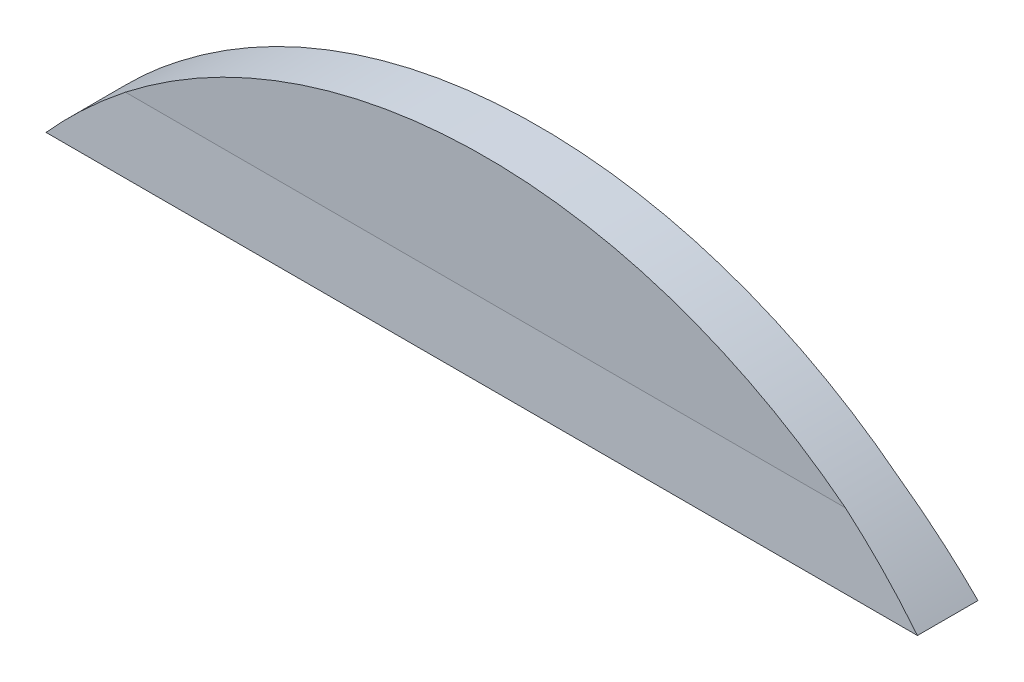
ISO-10303-21;
HEADER;
FILE_DESCRIPTION(('STEP AP214'),'2;1');
FILE_NAME('part.step','',(''),(''),'','','');
FILE_SCHEMA(('AUTOMOTIVE_DESIGN { 1 0 10303 214 1 1 1 1 }'));
ENDSEC;
DATA;
#1=APPLICATION_CONTEXT('core data for automotive mechanical design processes');
#2=APPLICATION_PROTOCOL_DEFINITION('international standard','automotive_design',2000,#1);
#3=PRODUCT_CONTEXT('',#1,'mechanical');
#4=PRODUCT('Part','Part','',(#3));
#5=PRODUCT_RELATED_PRODUCT_CATEGORY('part','',(#4));
#6=PRODUCT_DEFINITION_FORMATION('','',#4);
#7=PRODUCT_DEFINITION_CONTEXT('part definition',#1,'design');
#8=PRODUCT_DEFINITION('design','',#6,#7);
#9=PRODUCT_DEFINITION_SHAPE('','',#8);
#10=(LENGTH_UNIT() NAMED_UNIT(*) SI_UNIT(.MILLI.,.METRE.));
#11=(NAMED_UNIT(*) PLANE_ANGLE_UNIT() SI_UNIT($,.RADIAN.));
#12=(NAMED_UNIT(*) SI_UNIT($,.STERADIAN.) SOLID_ANGLE_UNIT());
#13=UNCERTAINTY_MEASURE_WITH_UNIT(LENGTH_MEASURE(1.E-05),#10,'distance_accuracy_value','');
#14=(GEOMETRIC_REPRESENTATION_CONTEXT(3) GLOBAL_UNCERTAINTY_ASSIGNED_CONTEXT((#13)) GLOBAL_UNIT_ASSIGNED_CONTEXT((#10,
#11,#12)) REPRESENTATION_CONTEXT('',''));
#15=CARTESIAN_POINT('',(0.,0.,0.));
#16=DIRECTION('',(0.,0.,1.));
#17=DIRECTION('',(1.,0.,0.));
#18=AXIS2_PLACEMENT_3D('',#15,#16,#17);
#19=CARTESIAN_POINT('',(0.,26.,-1.5));
#20=DIRECTION('',(0.,0.0523359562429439,-0.998629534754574));
#21=DIRECTION('',(0.,0.998629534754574,0.0523359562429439));
#22=AXIS2_PLACEMENT_3D('',#19,#20,#21);
#23=PLANE('',#22);
#24=DIRECTION('',(-1.,0.,0.));
#25=VECTOR('',#24,1.);
#26=CARTESIAN_POINT('',(0.,26.,-1.5));
#27=LINE('',#26,#25);
#28=CARTESIAN_POINT('',(20.3224014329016,26.,-1.5));
#29=VERTEX_POINT('',#28);
#30=CARTESIAN_POINT('',(-20.3224014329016,26.,-1.5));
#31=VERTEX_POINT('',#30);
#32=EDGE_CURVE('E11',#29,#31,#27,.T.);
#33=ORIENTED_EDGE('',*,*,#32,.F.);
#34=CARTESIAN_POINT('',(0.,0.,-2.86260226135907));
#35=DIRECTION('',(0.,0.0523359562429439,-0.998629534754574));
#36=DIRECTION('',(0.,-0.998629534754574,-0.0523359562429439));
#37=AXIS2_PLACEMENT_3D('',#34,#35,#36);
#38=ELLIPSE('',#37,33.0452874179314,33.);
#39=CARTESIAN_POINT('',(24.5967477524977,22.,-1.70963111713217));
#40=VERTEX_POINT('',#39);
#41=EDGE_CURVE('E101',#40,#29,#38,.F.);
#42=ORIENTED_EDGE('',*,*,#41,.F.);
#43=DIRECTION('',(-1.,0.,0.));
#44=VECTOR('',#43,1.);
#45=CARTESIAN_POINT('',(-24.5967477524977,22.,-1.70963111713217));
#46=LINE('',#45,#44);
#47=CARTESIAN_POINT('',(-24.5967477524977,22.,-1.70963111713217));
#48=VERTEX_POINT('',#47);
#49=EDGE_CURVE('E60',#48,#40,#46,.F.);
#50=ORIENTED_EDGE('',*,*,#49,.F.);
#51=CARTESIAN_POINT('',(0.,0.,-2.86260226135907));
#52=DIRECTION('',(0.,0.0523359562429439,-0.998629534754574));
#53=DIRECTION('',(0.,-0.998629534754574,-0.0523359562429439));
#54=AXIS2_PLACEMENT_3D('',#51,#52,#53);
#55=ELLIPSE('',#54,33.0452874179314,33.);
#56=EDGE_CURVE('E98',#31,#48,#55,.F.);
#57=ORIENTED_EDGE('',*,*,#56,.F.);
#58=EDGE_LOOP('',(#33,#42,#50,#57));
#59=FACE_BOUND('',#58,.T.);
#60=ADVANCED_FACE('F31',(#59),#23,.T.);
#61=CARTESIAN_POINT('',(0.,26.,1.5));
#62=DIRECTION('',(0.,0.0523359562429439,0.998629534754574));
#63=DIRECTION('',(0.,-0.998629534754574,0.0523359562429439));
#64=AXIS2_PLACEMENT_3D('',#61,#62,#63);
#65=PLANE('',#64);
#66=CARTESIAN_POINT('',(0.,0.,2.86260226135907));
#67=DIRECTION('',(0.,0.0523359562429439,0.998629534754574));
#68=DIRECTION('',(0.,0.998629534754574,-0.0523359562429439));
#69=AXIS2_PLACEMENT_3D('',#66,#67,#68);
#70=ELLIPSE('',#69,33.0452874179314,33.);
#71=CARTESIAN_POINT('',(24.5967477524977,22.,1.70963111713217));
#72=VERTEX_POINT('',#71);
#73=CARTESIAN_POINT('',(20.3224014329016,26.,1.5));
#74=VERTEX_POINT('',#73);
#75=EDGE_CURVE('E86',#72,#74,#70,.T.);
#76=ORIENTED_EDGE('',*,*,#75,.T.);
#77=DIRECTION('',(-1.,0.,0.));
#78=VECTOR('',#77,1.);
#79=CARTESIAN_POINT('',(0.,26.,1.5));
#80=LINE('',#79,#78);
#81=CARTESIAN_POINT('',(-20.3224014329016,26.,1.5));
#82=VERTEX_POINT('',#81);
#83=EDGE_CURVE('E40',#74,#82,#80,.T.);
#84=ORIENTED_EDGE('',*,*,#83,.T.);
#85=CARTESIAN_POINT('',(0.,0.,2.86260226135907));
#86=DIRECTION('',(0.,0.0523359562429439,0.998629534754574));
#87=DIRECTION('',(0.,0.998629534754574,-0.0523359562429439));
#88=AXIS2_PLACEMENT_3D('',#85,#86,#87);
#89=ELLIPSE('',#88,33.0452874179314,33.);
#90=CARTESIAN_POINT('',(-24.5967477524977,22.,1.70963111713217));
#91=VERTEX_POINT('',#90);
#92=EDGE_CURVE('E69',#82,#91,#89,.T.);
#93=ORIENTED_EDGE('',*,*,#92,.T.);
#94=DIRECTION('',(1.,0.,0.));
#95=VECTOR('',#94,1.);
#96=CARTESIAN_POINT('',(-24.5967477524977,22.,1.70963111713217));
#97=LINE('',#96,#95);
#98=EDGE_CURVE('E90',#91,#72,#97,.T.);
#99=ORIENTED_EDGE('',*,*,#98,.T.);
#100=EDGE_LOOP('',(#76,#84,#93,#99));
#101=FACE_BOUND('',#100,.T.);
#102=ADVANCED_FACE('F89',(#101),#65,.T.);
#103=CARTESIAN_POINT('',(0.,0.,1.5));
#104=DIRECTION('',(0.,0.,-1.));
#105=DIRECTION('',(-1.,0.,0.));
#106=AXIS2_PLACEMENT_3D('',#103,#104,#105);
#107=CYLINDRICAL_SURFACE('',#106,33.);
#108=ORIENTED_EDGE('',*,*,#41,.T.);
#109=CARTESIAN_POINT('',(0.,0.,-1.5));
#110=DIRECTION('',(0.,0.,1.));
#111=DIRECTION('',(1.,0.,0.));
#112=AXIS2_PLACEMENT_3D('',#109,#110,#111);
#113=CIRCLE('',#112,33.);
#114=EDGE_CURVE('E100',#29,#31,#113,.T.);
#115=ORIENTED_EDGE('',*,*,#114,.T.);
#116=ORIENTED_EDGE('',*,*,#56,.T.);
#117=DIRECTION('',(0.,0.,-1.));
#118=VECTOR('',#117,1.);
#119=CARTESIAN_POINT('',(-24.5967477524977,22.,1.5));
#120=LINE('',#119,#118);
#121=EDGE_CURVE('E80',#91,#48,#120,.T.);
#122=ORIENTED_EDGE('',*,*,#121,.F.);
#123=ORIENTED_EDGE('',*,*,#92,.F.);
#124=CARTESIAN_POINT('',(0.,0.,1.5));
#125=DIRECTION('',(0.,0.,1.));
#126=DIRECTION('',(1.,0.,0.));
#127=AXIS2_PLACEMENT_3D('',#124,#125,#126);
#128=CIRCLE('',#127,33.);
#129=EDGE_CURVE('E78',#74,#82,#128,.T.);
#130=ORIENTED_EDGE('',*,*,#129,.F.);
#131=ORIENTED_EDGE('',*,*,#75,.F.);
#132=DIRECTION('',(0.,0.,-1.));
#133=VECTOR('',#132,1.);
#134=CARTESIAN_POINT('',(24.5967477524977,22.,1.5));
#135=LINE('',#134,#133);
#136=EDGE_CURVE('E92',#72,#40,#135,.T.);
#137=ORIENTED_EDGE('',*,*,#136,.T.);
#138=EDGE_LOOP('',(#108,#115,#116,#122,#123,#130,#131,#137));
#139=FACE_BOUND('',#138,.T.);
#140=ADVANCED_FACE('F85',(#139),#107,.T.);
#141=CARTESIAN_POINT('',(-24.5967477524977,22.,1.5));
#142=DIRECTION('',(0.,1.,0.));
#143=DIRECTION('',(0.,0.,1.));
#144=AXIS2_PLACEMENT_3D('',#141,#142,#143);
#145=PLANE('',#144);
#146=ORIENTED_EDGE('',*,*,#49,.T.);
#147=ORIENTED_EDGE('',*,*,#136,.F.);
#148=ORIENTED_EDGE('',*,*,#98,.F.);
#149=ORIENTED_EDGE('',*,*,#121,.T.);
#150=EDGE_LOOP('',(#146,#147,#148,#149));
#151=FACE_BOUND('',#150,.T.);
#152=ADVANCED_FACE('F112',(#151),#145,.F.);
#153=CARTESIAN_POINT('',(0.,0.,1.5));
#154=DIRECTION('',(0.,0.,1.));
#155=DIRECTION('',(1.,0.,0.));
#156=AXIS2_PLACEMENT_3D('',#153,#154,#155);
#157=PLANE('',#156);
#158=ORIENTED_EDGE('',*,*,#83,.F.);
#159=ORIENTED_EDGE('',*,*,#129,.T.);
#160=EDGE_LOOP('',(#158,#159));
#161=FACE_BOUND('',#160,.T.);
#162=ADVANCED_FACE('F77',(#161),#157,.T.);
#163=CARTESIAN_POINT('',(0.,0.,-1.5));
#164=DIRECTION('',(0.,0.,1.));
#165=DIRECTION('',(1.,0.,0.));
#166=AXIS2_PLACEMENT_3D('',#163,#164,#165);
#167=PLANE('',#166);
#168=ORIENTED_EDGE('',*,*,#114,.F.);
#169=ORIENTED_EDGE('',*,*,#32,.T.);
#170=EDGE_LOOP('',(#168,#169));
#171=FACE_BOUND('',#170,.T.);
#172=ADVANCED_FACE('F106',(#171),#167,.F.);
#173=CLOSED_SHELL('',(#60,#102,#140,#152,#162,#172));
#174=MANIFOLD_SOLID_BREP('B2',#173);
#175=ADVANCED_BREP_SHAPE_REPRESENTATION('',(#18,#174),#14);
#176=SHAPE_DEFINITION_REPRESENTATION(#9,#175);
ENDSEC;
END-ISO-10303-21;
